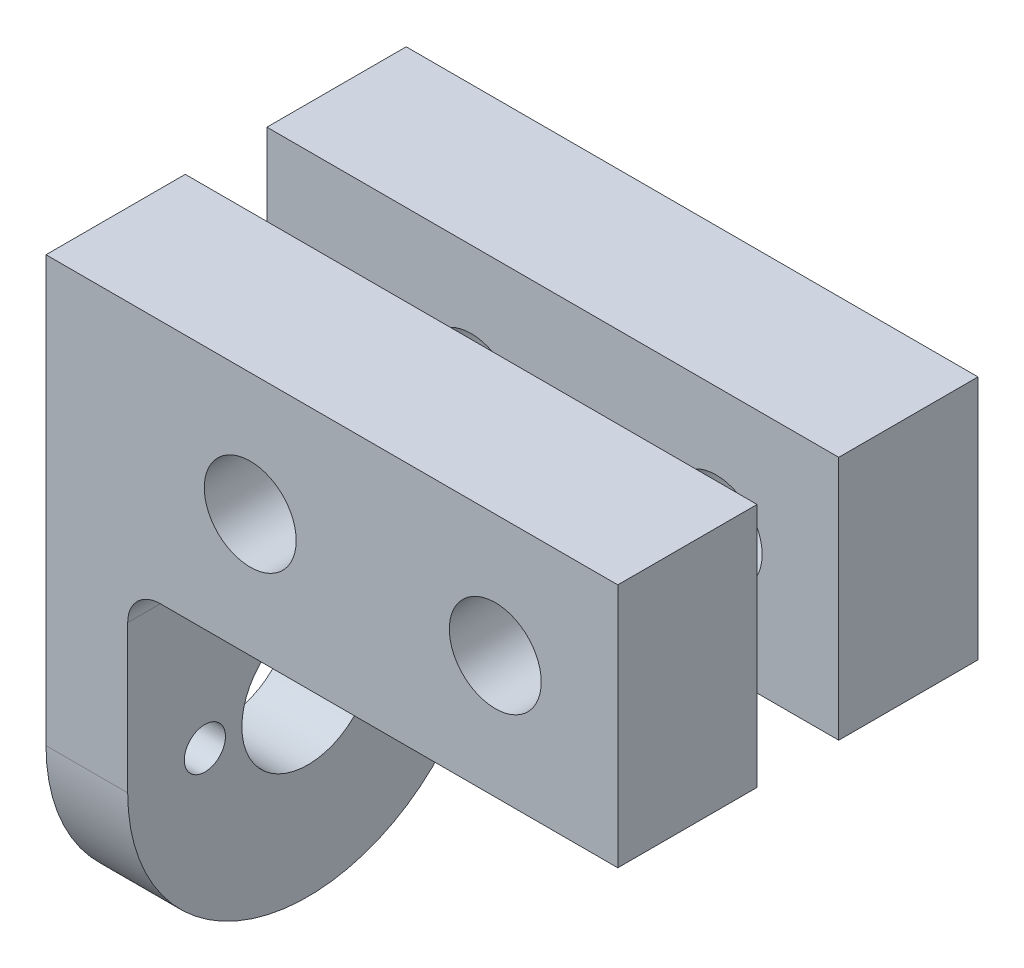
from build123d import *

# Parameters (mm, degrees)
SKETCH1_W               = 10.825
SKETCH1_H               = 19.05
BOSS_EXTRUDE1_DEPTH     = 38.1
BOSS_EXTRUDE1_2_DEPTH   = 38.1
CUT_EXTRUDE1_DEPTH      = 49.232101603
CUT_EXTRUDE1_DEPTH_BACK = 49.232101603
SKETCH2_R               = 3.571875
SKETCH3_R               = 1.6
SKETCH3_R_2             = 5.125
BOSS_EXTRUDE2_DEPTH     = 6.35
FILLET1_R               = 2.54


with BuildPart() as part:
    # Sketch1 → Boss-Extrude1 (new body)
    with BuildSketch(Plane(origin=(0, 0, 0), x_dir=(0, 0, -1), z_dir=(1, 0, 0))):
        with Locations((-8.5875, 0)):
            Rectangle(SKETCH1_W, SKETCH1_H)
    extrude(amount=-BOSS_EXTRUDE1_DEPTH)


with BuildPart() as body_2:
    # Sketch1 → Boss-Extrude1 2 (new body)
    with BuildSketch(Plane(origin=(0, 0, 0), x_dir=(0, 0, -1), z_dir=(1, 0, 0))):
        with Locations((8.5875, 0)):
            Rectangle(SKETCH1_W, SKETCH1_H)
    extrude(amount=-BOSS_EXTRUDE1_2_DEPTH)


with BuildPart() as cut_extrude1_tool:
    # Sketch2 → Cut-Extrude1 (new, two sides: drawn at the far end of the back side and taken through both)
    with BuildSketch(Plane.XY.offset(14).offset(-CUT_EXTRUDE1_DEPTH_BACK)):
        with Locations((-28.575, 0)):
            Circle(SKETCH2_R)
        with Locations((-9.525, 0)):
            Circle(SKETCH2_R)
    extrude(amount=CUT_EXTRUDE1_DEPTH + CUT_EXTRUDE1_DEPTH_BACK)


with BuildPart() as part_1:
    add(part.part)

    # Cut-Extrude1: cut by cut_extrude1_tool
    add(cut_extrude1_tool.part, mode=Mode.SUBTRACT)



with BuildPart() as body_2_1:
    add(body_2.part)

    # Cut-Extrude1: cut by cut_extrude1_tool
    add(cut_extrude1_tool.part, mode=Mode.SUBTRACT)


with BuildPart() as part_2:
    add(part_1.part)

    add(body_2_1.part)  # Boss-Extrude2 merges body 2
    # Sketch3 → Boss-Extrude2 (add)
    with BuildSketch(Plane.ZY.offset(38.1)):
        with BuildLine():
            Line((-3.175, -9.525), (-3.175, 9.525))
            Line((-3.175, 9.525), (-14, 9.525))
            Line((-14, 9.525), (-14, -23.525))
            ThreePointArc((-14, -23.525), (0, -37.525), (14, -23.525))
            Line((14, -23.525), (14, 9.525))
            Line((14, 9.525), (3.175, 9.525))
            Line((3.175, 9.525), (3.175, -9.525))
            Line((3.175, -9.525), (-3.175, -9.525))
        make_face()
        with Locations((8, -23.525)):
            Circle(SKETCH3_R, mode=Mode.SUBTRACT)
        with Locations((-8, -23.525)):
            Circle(SKETCH3_R, mode=Mode.SUBTRACT)
        with Locations((0, -23.525)):
            Circle(SKETCH3_R_2, mode=Mode.SUBTRACT)
    extrude(amount=BOSS_EXTRUDE2_DEPTH)

    # Fillet1
    fillet1_edges = [part_2.edges().sort_by_distance(p)[0] for p in [
        (-38.1, -9.525, 8.5875),
        (-38.1, -9.525, -8.5875),
    ]]
    fillet(fillet1_edges, radius=FILLET1_R)


solid = part_2.part
